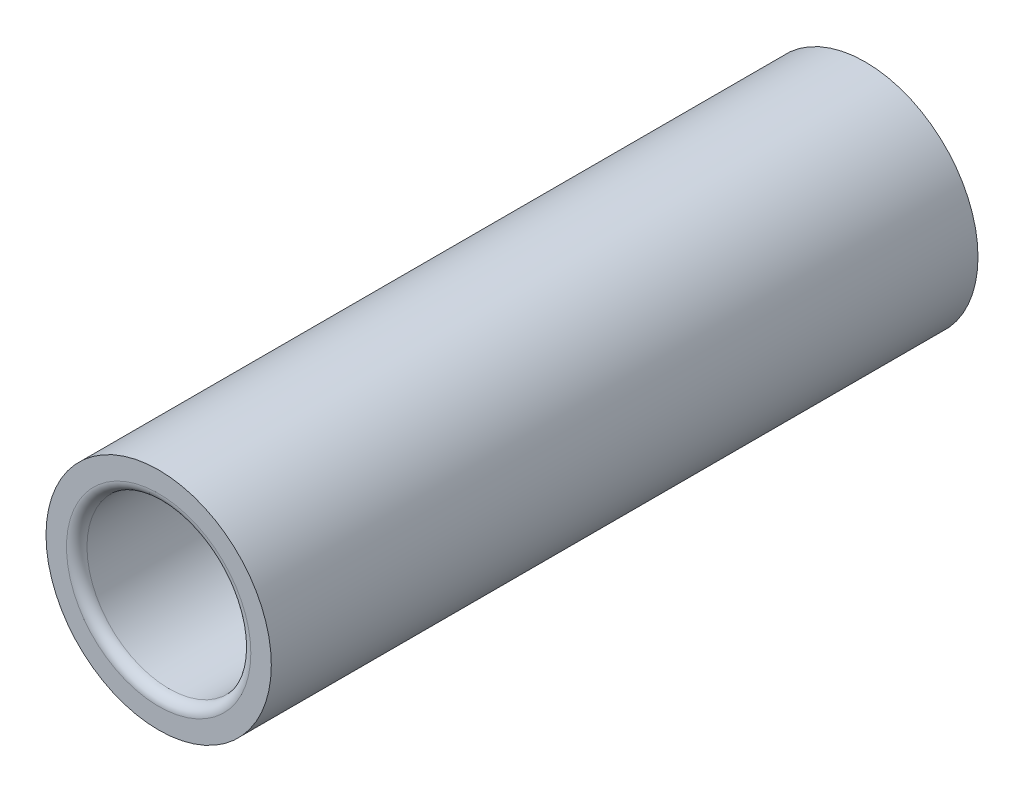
from build123d import *

# Parameters (mm, degrees)
BOSS_EXTRUDE1_DEPTH      = 34.5
BOSS_EXTRUDE1_DEPTH_BACK = 34.5
SKETCH1_R                = 11
SKETCH1_R_2              = 8
FILLET1_R                = 1


with BuildPart() as part:
    # Sketch1 → Boss-Extrude1 (new, two sides: drawn at the far end of the back side and taken through both)
    with BuildSketch(Plane.XY.offset(-BOSS_EXTRUDE1_DEPTH_BACK)):
        Circle(SKETCH1_R)
        Circle(SKETCH1_R_2, mode=Mode.SUBTRACT)
    extrude(amount=BOSS_EXTRUDE1_DEPTH + BOSS_EXTRUDE1_DEPTH_BACK)

    # Fillet1
    fillet1_edges = [part.edges().sort_by_distance(p)[0] for p in [
        (-8, 0, -34.5),
        (-8, 0, 34.5),
    ]]
    fillet(fillet1_edges, radius=FILLET1_R)


solid = part.part
